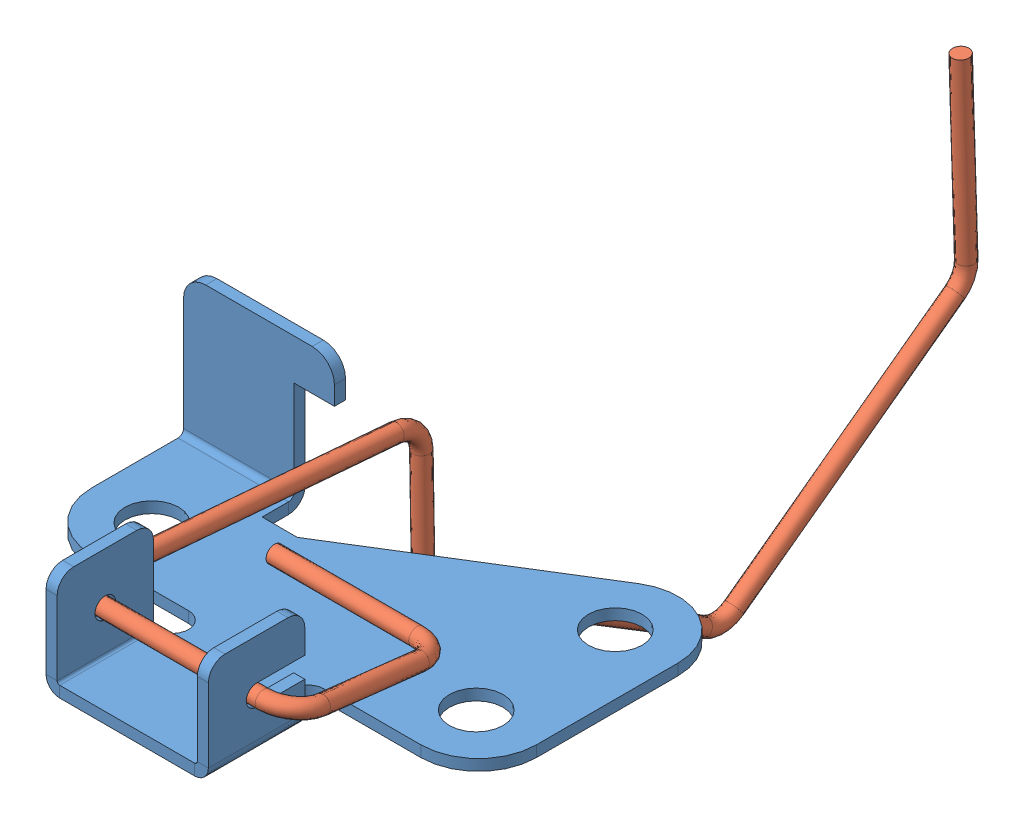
SolidWorks assembly Switch Rollover - Sys7.SLDASM, configuration Default (file format 8000). Lengths in mm.
Overall size (30.48 32.93 66.19).
2 component instances, 2 part files, 3 mates.
Components (placement in the parent):
- Switch Roll-over Sys7-Plate-1: Switch Roll-over Sys7-Plate.SLDPRT [Default] at origin size (30.48 10.41 26.47)
- Switch Roll-over Sys7-Wire-1: Switch Roll-over Sys7-Wire.SLDPRT [Default] at (-7.0993 2.8606 9.4996) x (-1 0 0) z (0 0.082899 0.996558) size (16.18 27.44 63.14)
Mates (geometry in assembly coordinates):
- Concentric1: concentric: circle of Switch Roll-over Sys7-Plate-1; cylinder of Switch Roll-over Sys7-Wire-1 through (6.0371 2.8606 9.4996) axis (-1 0 0) radius 0.5715
- Distance1: distance = 0.5715 mm: line of Switch Roll-over Sys7-Wire-1 through (-7.0993 0.8708 -14.4208) axis (0 -0.999861 -0.016673); plane of Switch Roll-over Sys7-Plate-1 through (-7.6708 0 -7.0612) normal (1 0 0)
- Distance2: distance = 0.5715 mm: plane of Switch Roll-over Sys7-Plate-1 through (11.2776 0 -9.7028) normal (0 1 0); line of Switch Roll-over Sys7-Wire-1 through (6.9977 0.5715 -1.7795) axis (-1 0 0)
